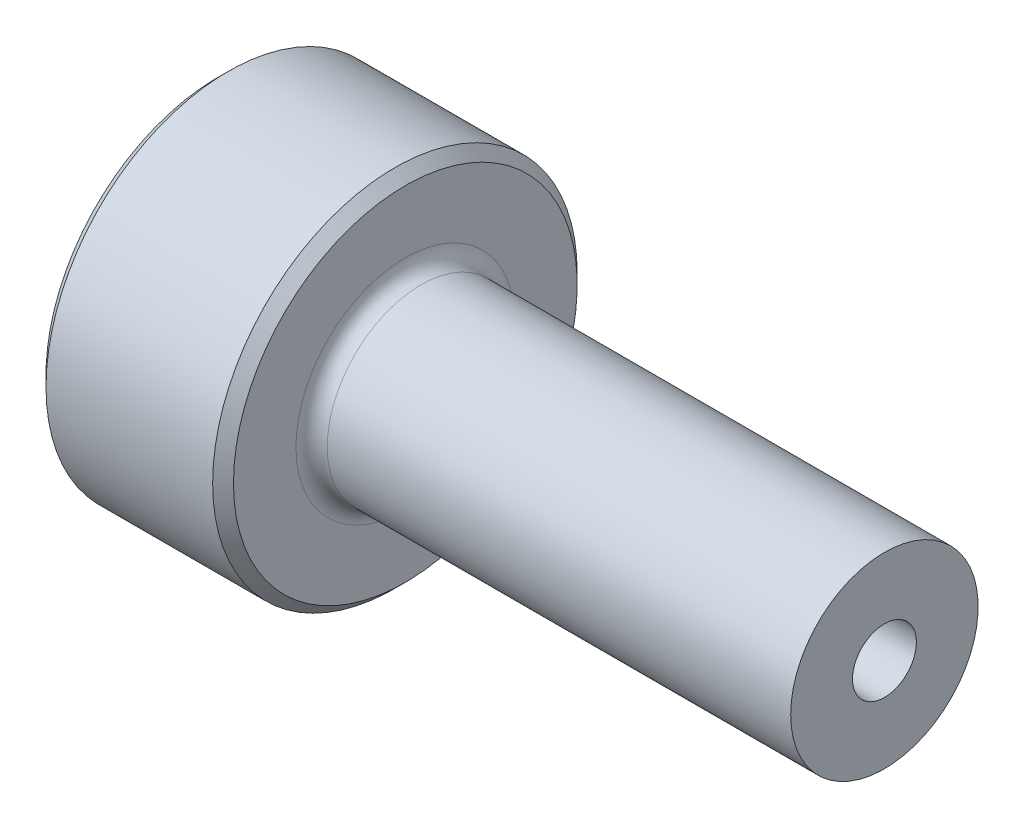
ISO-10303-21;
HEADER;
FILE_DESCRIPTION(('STEP AP214'),'2;1');
FILE_NAME('part.step','',(''),(''),'','','');
FILE_SCHEMA(('AUTOMOTIVE_DESIGN { 1 0 10303 214 1 1 1 1 }'));
ENDSEC;
DATA;
#1=APPLICATION_CONTEXT('core data for automotive mechanical design processes');
#2=APPLICATION_PROTOCOL_DEFINITION('international standard','automotive_design',2000,#1);
#3=PRODUCT_CONTEXT('',#1,'mechanical');
#4=PRODUCT('Part','Part','',(#3));
#5=PRODUCT_RELATED_PRODUCT_CATEGORY('part','',(#4));
#6=PRODUCT_DEFINITION_FORMATION('','',#4);
#7=PRODUCT_DEFINITION_CONTEXT('part definition',#1,'design');
#8=PRODUCT_DEFINITION('design','',#6,#7);
#9=PRODUCT_DEFINITION_SHAPE('','',#8);
#10=(LENGTH_UNIT() NAMED_UNIT(*) SI_UNIT(.MILLI.,.METRE.));
#11=(NAMED_UNIT(*) PLANE_ANGLE_UNIT() SI_UNIT($,.RADIAN.));
#12=(NAMED_UNIT(*) SI_UNIT($,.STERADIAN.) SOLID_ANGLE_UNIT());
#13=UNCERTAINTY_MEASURE_WITH_UNIT(LENGTH_MEASURE(1.E-05),#10,'distance_accuracy_value','');
#14=(GEOMETRIC_REPRESENTATION_CONTEXT(3) GLOBAL_UNCERTAINTY_ASSIGNED_CONTEXT((#13)) GLOBAL_UNIT_ASSIGNED_CONTEXT((#10,
#11,#12)) REPRESENTATION_CONTEXT('',''));
#15=CARTESIAN_POINT('',(0.,0.,0.));
#16=DIRECTION('',(0.,0.,1.));
#17=DIRECTION('',(1.,0.,0.));
#18=AXIS2_PLACEMENT_3D('',#15,#16,#17);
#19=CARTESIAN_POINT('',(0.,4.10062261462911,0.));
#20=DIRECTION('',(1.,0.,0.));
#21=DIRECTION('',(0.,0.,-1.));
#22=AXIS2_PLACEMENT_3D('',#19,#20,#21);
#23=PLANE('',#22);
#24=CARTESIAN_POINT('',(0.,0.,0.));
#25=DIRECTION('',(1.,0.,0.));
#26=DIRECTION('',(0.,0.,-1.));
#27=AXIS2_PLACEMENT_3D('',#24,#25,#26);
#28=CIRCLE('',#27,16.5);
#29=CARTESIAN_POINT('',(0.,0.,-16.5));
#30=VERTEX_POINT('',#29);
#31=EDGE_CURVE('E9',#30,#30,#28,.F.);
#32=ORIENTED_EDGE('',*,*,#31,.T.);
#33=EDGE_LOOP('',(#32));
#34=FACE_BOUND('',#33,.T.);
#35=CARTESIAN_POINT('',(0.,0.,0.));
#36=DIRECTION('',(-1.,0.,0.));
#37=DIRECTION('',(0.,0.,1.));
#38=AXIS2_PLACEMENT_3D('',#35,#36,#37);
#39=CIRCLE('',#38,4.10062261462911);
#40=CARTESIAN_POINT('',(0.,0.,4.10062261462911));
#41=VERTEX_POINT('',#40);
#42=EDGE_CURVE('E49',#41,#41,#39,.T.);
#43=ORIENTED_EDGE('',*,*,#42,.F.);
#44=EDGE_LOOP('',(#43));
#45=FACE_BOUND('',#44,.T.);
#46=ADVANCED_FACE('F14',(#34,#45),#23,.F.);
#47=CARTESIAN_POINT('',(0.,0.,0.));
#48=DIRECTION('',(-1.,0.,0.));
#49=DIRECTION('',(0.,0.,1.));
#50=AXIS2_PLACEMENT_3D('',#47,#48,#49);
#51=CYLINDRICAL_SURFACE('',#50,17.5);
#52=CARTESIAN_POINT('',(17.,0.,0.));
#53=DIRECTION('',(-1.,0.,0.));
#54=DIRECTION('',(0.,0.,1.));
#55=AXIS2_PLACEMENT_3D('',#52,#53,#54);
#56=CIRCLE('',#55,17.5);
#57=CARTESIAN_POINT('',(17.,0.,17.5));
#58=VERTEX_POINT('',#57);
#59=EDGE_CURVE('E25',#58,#58,#56,.T.);
#60=ORIENTED_EDGE('',*,*,#59,.T.);
#61=EDGE_LOOP('',(#60));
#62=FACE_BOUND('',#61,.T.);
#63=CARTESIAN_POINT('',(1.,0.,0.));
#64=DIRECTION('',(1.,0.,0.));
#65=DIRECTION('',(0.,0.,-1.));
#66=AXIS2_PLACEMENT_3D('',#63,#64,#65);
#67=CIRCLE('',#66,17.5);
#68=CARTESIAN_POINT('',(1.,0.,-17.5));
#69=VERTEX_POINT('',#68);
#70=EDGE_CURVE('E29',#69,#69,#67,.T.);
#71=ORIENTED_EDGE('',*,*,#70,.T.);
#72=EDGE_LOOP('',(#71));
#73=FACE_BOUND('',#72,.T.);
#74=ADVANCED_FACE('F56',(#62,#73),#51,.T.);
#75=CARTESIAN_POINT('',(18.,17.5,0.));
#76=DIRECTION('',(-1.,0.,0.));
#77=DIRECTION('',(0.,0.,1.));
#78=AXIS2_PLACEMENT_3D('',#75,#76,#77);
#79=PLANE('',#78);
#80=CARTESIAN_POINT('',(18.,0.,0.));
#81=DIRECTION('',(-1.,0.,0.));
#82=DIRECTION('',(0.,0.,1.));
#83=AXIS2_PLACEMENT_3D('',#80,#81,#82);
#84=CIRCLE('',#83,16.5);
#85=CARTESIAN_POINT('',(18.,0.,16.5));
#86=VERTEX_POINT('',#85);
#87=EDGE_CURVE('E21',#86,#86,#84,.F.);
#88=ORIENTED_EDGE('',*,*,#87,.T.);
#89=EDGE_LOOP('',(#88));
#90=FACE_BOUND('',#89,.T.);
#91=CARTESIAN_POINT('',(18.,0.,0.));
#92=DIRECTION('',(-1.,0.,0.));
#93=DIRECTION('',(0.,0.,1.));
#94=AXIS2_PLACEMENT_3D('',#91,#92,#93);
#95=CIRCLE('',#94,10.5);
#96=CARTESIAN_POINT('',(18.,0.,10.5));
#97=VERTEX_POINT('',#96);
#98=EDGE_CURVE('E34',#97,#97,#95,.T.);
#99=ORIENTED_EDGE('',*,*,#98,.T.);
#100=EDGE_LOOP('',(#99));
#101=FACE_BOUND('',#100,.T.);
#102=ADVANCED_FACE('F63',(#90,#101),#79,.F.);
#103=CARTESIAN_POINT('',(19.5,0.,0.));
#104=DIRECTION('',(-1.,0.,0.));
#105=DIRECTION('',(0.,0.,1.));
#106=AXIS2_PLACEMENT_3D('',#103,#104,#105);
#107=TOROIDAL_SURFACE('',#106,10.5,1.5);
#108=ORIENTED_EDGE('',*,*,#98,.F.);
#109=EDGE_LOOP('',(#108));
#110=FACE_BOUND('',#109,.T.);
#111=CARTESIAN_POINT('',(19.5,0.,0.));
#112=DIRECTION('',(-1.,0.,0.));
#113=DIRECTION('',(0.,0.,1.));
#114=AXIS2_PLACEMENT_3D('',#111,#112,#113);
#115=CIRCLE('',#114,9.);
#116=CARTESIAN_POINT('',(19.5,0.,9.));
#117=VERTEX_POINT('',#116);
#118=EDGE_CURVE('E37',#117,#117,#115,.T.);
#119=ORIENTED_EDGE('',*,*,#118,.T.);
#120=EDGE_LOOP('',(#119));
#121=FACE_BOUND('',#120,.T.);
#122=ADVANCED_FACE('F99',(#110,#121),#107,.F.);
#123=CARTESIAN_POINT('',(0.,0.,0.));
#124=DIRECTION('',(-1.,0.,0.));
#125=DIRECTION('',(0.,0.,1.));
#126=AXIS2_PLACEMENT_3D('',#123,#124,#125);
#127=CYLINDRICAL_SURFACE('',#126,9.);
#128=ORIENTED_EDGE('',*,*,#118,.F.);
#129=EDGE_LOOP('',(#128));
#130=FACE_BOUND('',#129,.T.);
#131=CARTESIAN_POINT('',(64.,0.,0.));
#132=DIRECTION('',(-1.,0.,0.));
#133=DIRECTION('',(0.,0.,1.));
#134=AXIS2_PLACEMENT_3D('',#131,#132,#133);
#135=CIRCLE('',#134,9.);
#136=CARTESIAN_POINT('',(64.,0.,9.));
#137=VERTEX_POINT('',#136);
#138=EDGE_CURVE('E40',#137,#137,#135,.T.);
#139=ORIENTED_EDGE('',*,*,#138,.T.);
#140=EDGE_LOOP('',(#139));
#141=FACE_BOUND('',#140,.T.);
#142=ADVANCED_FACE('F95',(#130,#141),#127,.T.);
#143=CARTESIAN_POINT('',(64.,3.06475896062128,0.));
#144=DIRECTION('',(-1.,0.,0.));
#145=DIRECTION('',(0.,0.,1.));
#146=AXIS2_PLACEMENT_3D('',#143,#144,#145);
#147=PLANE('',#146);
#148=ORIENTED_EDGE('',*,*,#138,.F.);
#149=EDGE_LOOP('',(#148));
#150=FACE_BOUND('',#149,.T.);
#151=CARTESIAN_POINT('',(64.,0.,0.));
#152=DIRECTION('',(-1.,0.,0.));
#153=DIRECTION('',(0.,0.,1.));
#154=AXIS2_PLACEMENT_3D('',#151,#152,#153);
#155=CIRCLE('',#154,3.06475896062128);
#156=CARTESIAN_POINT('',(64.,0.,3.06475896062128));
#157=VERTEX_POINT('',#156);
#158=EDGE_CURVE('E43',#157,#157,#155,.T.);
#159=ORIENTED_EDGE('',*,*,#158,.T.);
#160=EDGE_LOOP('',(#159));
#161=FACE_BOUND('',#160,.T.);
#162=ADVANCED_FACE('F88',(#150,#161),#147,.F.);
#163=CARTESIAN_POINT('',(3.,0.,0.));
#164=DIRECTION('',(1.,0.,0.));
#165=DIRECTION('',(0.,0.,-1.));
#166=AXIS2_PLACEMENT_3D('',#163,#164,#165);
#167=CONICAL_SURFACE('',#166,2.,0.0174532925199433);
#168=ORIENTED_EDGE('',*,*,#158,.F.);
#169=EDGE_LOOP('',(#168));
#170=FACE_BOUND('',#169,.T.);
#171=CARTESIAN_POINT('',(3.,0.,0.));
#172=DIRECTION('',(-1.,0.,0.));
#173=DIRECTION('',(0.,0.,1.));
#174=AXIS2_PLACEMENT_3D('',#171,#172,#173);
#175=CIRCLE('',#174,2.);
#176=CARTESIAN_POINT('',(3.,0.,2.));
#177=VERTEX_POINT('',#176);
#178=EDGE_CURVE('E46',#177,#177,#175,.T.);
#179=ORIENTED_EDGE('',*,*,#178,.T.);
#180=EDGE_LOOP('',(#179));
#181=FACE_BOUND('',#180,.T.);
#182=ADVANCED_FACE('F76',(#170,#181),#167,.F.);
#183=CARTESIAN_POINT('',(0.,0.,0.));
#184=DIRECTION('',(-1.,0.,0.));
#185=DIRECTION('',(0.,0.,1.));
#186=AXIS2_PLACEMENT_3D('',#183,#184,#185);
#187=CONICAL_SURFACE('',#186,4.10062261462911,0.61086523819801);
#188=ORIENTED_EDGE('',*,*,#178,.F.);
#189=EDGE_LOOP('',(#188));
#190=FACE_BOUND('',#189,.T.);
#191=ORIENTED_EDGE('',*,*,#42,.T.);
#192=EDGE_LOOP('',(#191));
#193=FACE_BOUND('',#192,.T.);
#194=ADVANCED_FACE('F53',(#190,#193),#187,.F.);
#195=CARTESIAN_POINT('',(17.,0.,0.));
#196=DIRECTION('',(-1.,0.,0.));
#197=DIRECTION('',(0.,0.,1.));
#198=AXIS2_PLACEMENT_3D('',#195,#196,#197);
#199=CONICAL_SURFACE('',#198,17.5,0.785398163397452);
#200=ORIENTED_EDGE('',*,*,#87,.F.);
#201=EDGE_LOOP('',(#200));
#202=FACE_BOUND('',#201,.T.);
#203=ORIENTED_EDGE('',*,*,#59,.F.);
#204=EDGE_LOOP('',(#203));
#205=FACE_BOUND('',#204,.T.);
#206=ADVANCED_FACE('F67',(#202,#205),#199,.T.);
#207=CARTESIAN_POINT('',(0.,0.,0.));
#208=DIRECTION('',(1.,0.,0.));
#209=DIRECTION('',(0.,0.,-1.));
#210=AXIS2_PLACEMENT_3D('',#207,#208,#209);
#211=CONICAL_SURFACE('',#210,16.5,0.785398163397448);
#212=ORIENTED_EDGE('',*,*,#70,.F.);
#213=EDGE_LOOP('',(#212));
#214=FACE_BOUND('',#213,.T.);
#215=ORIENTED_EDGE('',*,*,#31,.F.);
#216=EDGE_LOOP('',(#215));
#217=FACE_BOUND('',#216,.T.);
#218=ADVANCED_FACE('F16',(#214,#217),#211,.T.);
#219=CLOSED_SHELL('',(#46,#74,#102,#122,#142,#162,#182,#194,#206,#218));
#220=MANIFOLD_SOLID_BREP('B1',#219);
#221=ADVANCED_BREP_SHAPE_REPRESENTATION('',(#18,#220),#14);
#222=SHAPE_DEFINITION_REPRESENTATION(#9,#221);
ENDSEC;
END-ISO-10303-21;
